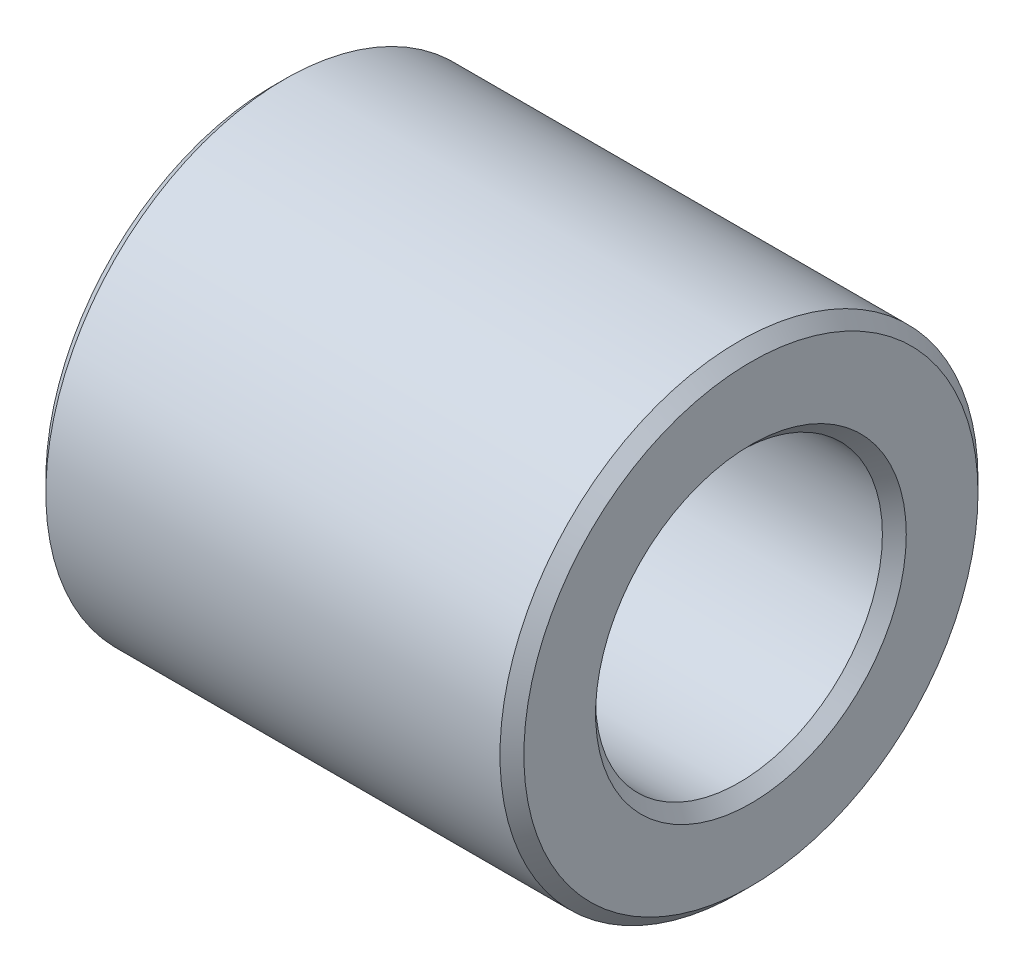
from build123d import *

# Parameters (mm, degrees)
SKETCH_1_R      = 5
SKETCH_1_R_2    = 3
EXTRUDE_1_DEPTH = 10
CHAMFER_1_SIZE  = 0.25


with BuildPart() as part:
    # Sketch 1 → Extrude 1 (new body)
    with BuildSketch(Plane(origin=(0, 0, 0), x_dir=(0, 0, -1), z_dir=(1, 0, 0))):
        Circle(SKETCH_1_R)
        Circle(SKETCH_1_R_2, mode=Mode.SUBTRACT)
    extrude(amount=EXTRUDE_1_DEPTH)

    # Chamfer 1
    chamfer_1_edges = [part.edges().sort_by_distance(p)[0] for p in [
        (0, 0, 5),
        (10, 0, 5),
        (0, 0, 3),
        (10, 0, 3),
    ]]
    chamfer(chamfer_1_edges, length=CHAMFER_1_SIZE)


solid = part.part
